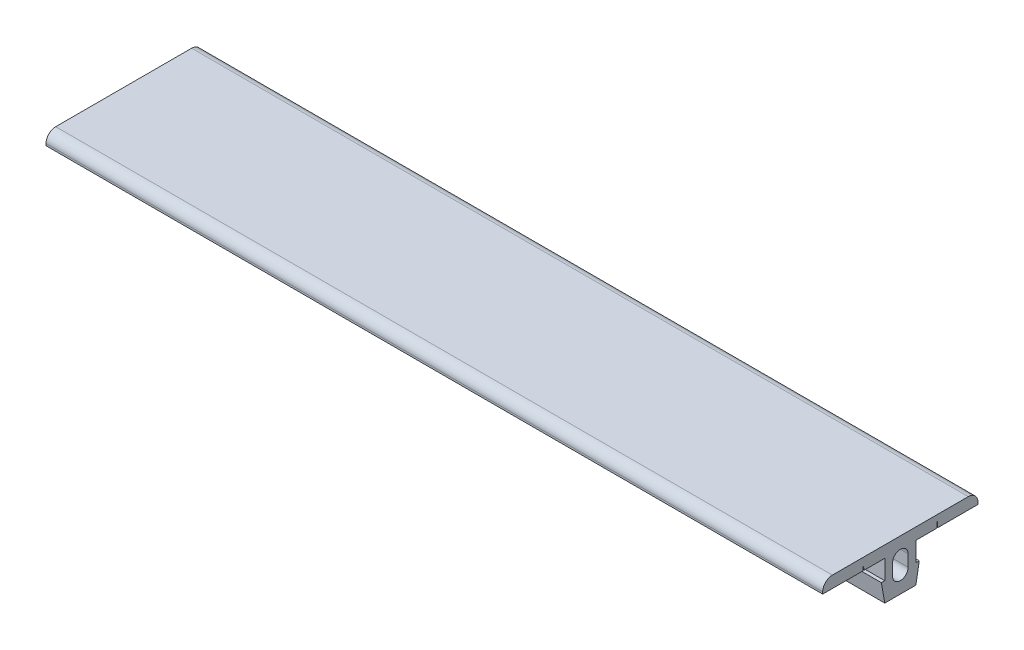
ISO-10303-21;
HEADER;
FILE_DESCRIPTION(('STEP AP214'),'2;1');
FILE_NAME('part.step','',(''),(''),'','','');
FILE_SCHEMA(('AUTOMOTIVE_DESIGN { 1 0 10303 214 1 1 1 1 }'));
ENDSEC;
DATA;
#1=APPLICATION_CONTEXT('core data for automotive mechanical design processes');
#2=APPLICATION_PROTOCOL_DEFINITION('international standard','automotive_design',2000,#1);
#3=PRODUCT_CONTEXT('',#1,'mechanical');
#4=PRODUCT('Part','Part','',(#3));
#5=PRODUCT_RELATED_PRODUCT_CATEGORY('part','',(#4));
#6=PRODUCT_DEFINITION_FORMATION('','',#4);
#7=PRODUCT_DEFINITION_CONTEXT('part definition',#1,'design');
#8=PRODUCT_DEFINITION('design','',#6,#7);
#9=PRODUCT_DEFINITION_SHAPE('','',#8);
#10=(LENGTH_UNIT() NAMED_UNIT(*) SI_UNIT(.MILLI.,.METRE.));
#11=(NAMED_UNIT(*) PLANE_ANGLE_UNIT() SI_UNIT($,.RADIAN.));
#12=(NAMED_UNIT(*) SI_UNIT($,.STERADIAN.) SOLID_ANGLE_UNIT());
#13=UNCERTAINTY_MEASURE_WITH_UNIT(LENGTH_MEASURE(1.E-05),#10,'distance_accuracy_value','');
#14=(GEOMETRIC_REPRESENTATION_CONTEXT(3) GLOBAL_UNCERTAINTY_ASSIGNED_CONTEXT((#13)) GLOBAL_UNIT_ASSIGNED_CONTEXT((#10,
#11,#12)) REPRESENTATION_CONTEXT('',''));
#15=CARTESIAN_POINT('',(0.,0.,0.));
#16=DIRECTION('',(0.,0.,1.));
#17=DIRECTION('',(1.,0.,0.));
#18=AXIS2_PLACEMENT_3D('',#15,#16,#17);
#19=CARTESIAN_POINT('',(200.,4.93374739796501,-9.500000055));
#20=DIRECTION('',(0.,0.0871107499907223,-0.996198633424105));
#21=DIRECTION('',(0.,0.996198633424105,0.0871107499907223));
#22=AXIS2_PLACEMENT_3D('',#19,#20,#21);
#23=PLANE('',#22);
#24=DIRECTION('',(0.,-0.996198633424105,-0.0871107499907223));
#25=VECTOR('',#24,1.);
#26=CARTESIAN_POINT('',(0.,4.93374739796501,-9.500000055));
#27=LINE('',#26,#25);
#28=CARTESIAN_POINT('',(0.,4.93374739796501,-9.500000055));
#29=VERTEX_POINT('',#28);
#30=CARTESIAN_POINT('',(0.,3.43444739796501,-9.631103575));
#31=VERTEX_POINT('',#30);
#32=EDGE_CURVE('E327',#29,#31,#27,.T.);
#33=ORIENTED_EDGE('',*,*,#32,.T.);
#34=DIRECTION('',(-1.,0.,0.));
#35=VECTOR('',#34,1.);
#36=CARTESIAN_POINT('',(200.,3.43444739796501,-9.631103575));
#37=LINE('',#36,#35);
#38=CARTESIAN_POINT('',(200.,3.43444739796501,-9.631103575));
#39=VERTEX_POINT('',#38);
#40=EDGE_CURVE('E13',#39,#31,#37,.T.);
#41=ORIENTED_EDGE('',*,*,#40,.F.);
#42=DIRECTION('',(0.,-0.996198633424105,-0.0871107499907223));
#43=VECTOR('',#42,1.);
#44=CARTESIAN_POINT('',(200.,4.93374739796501,-9.500000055));
#45=LINE('',#44,#43);
#46=CARTESIAN_POINT('',(200.,4.93374739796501,-9.500000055));
#47=VERTEX_POINT('',#46);
#48=EDGE_CURVE('E484',#47,#39,#45,.T.);
#49=ORIENTED_EDGE('',*,*,#48,.F.);
#50=DIRECTION('',(-1.,0.,0.));
#51=VECTOR('',#50,1.);
#52=CARTESIAN_POINT('',(200.,4.93374739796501,-9.500000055));
#53=LINE('',#52,#51);
#54=EDGE_CURVE('E386',#47,#29,#53,.T.);
#55=ORIENTED_EDGE('',*,*,#54,.T.);
#56=EDGE_LOOP('',(#33,#41,#49,#55));
#57=FACE_BOUND('',#56,.T.);
#58=ADVANCED_FACE('F110',(#57),#23,.F.);
#59=CARTESIAN_POINT('',(200.,3.43444739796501,-9.631103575));
#60=DIRECTION('',(0.,1.,0.));
#61=DIRECTION('',(0.,0.,1.));
#62=AXIS2_PLACEMENT_3D('',#59,#60,#61);
#63=PLANE('',#62);
#64=DIRECTION('',(0.,0.,-1.));
#65=VECTOR('',#64,1.);
#66=CARTESIAN_POINT('',(0.,3.43444739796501,-9.631103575));
#67=LINE('',#66,#65);
#68=CARTESIAN_POINT('',(0.,3.43444739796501,-20.000000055));
#69=VERTEX_POINT('',#68);
#70=EDGE_CURVE('E331',#31,#69,#67,.T.);
#71=ORIENTED_EDGE('',*,*,#70,.T.);
#72=DIRECTION('',(-1.,0.,0.));
#73=VECTOR('',#72,1.);
#74=CARTESIAN_POINT('',(200.,3.43444739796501,-20.000000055));
#75=LINE('',#74,#73);
#76=CARTESIAN_POINT('',(200.,3.43444739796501,-20.000000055));
#77=VERTEX_POINT('',#76);
#78=EDGE_CURVE('E121',#77,#69,#75,.T.);
#79=ORIENTED_EDGE('',*,*,#78,.F.);
#80=DIRECTION('',(0.,0.,-1.));
#81=VECTOR('',#80,1.);
#82=CARTESIAN_POINT('',(200.,3.43444739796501,-9.631103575));
#83=LINE('',#82,#81);
#84=EDGE_CURVE('E487',#39,#77,#83,.T.);
#85=ORIENTED_EDGE('',*,*,#84,.F.);
#86=ORIENTED_EDGE('',*,*,#40,.T.);
#87=EDGE_LOOP('',(#71,#79,#85,#86));
#88=FACE_BOUND('',#87,.T.);
#89=ADVANCED_FACE('F562',(#88),#63,.F.);
#90=CARTESIAN_POINT('',(200.,3.43444739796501,-20.000000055));
#91=DIRECTION('',(0.,0.,1.));
#92=DIRECTION('',(1.,0.,0.));
#93=AXIS2_PLACEMENT_3D('',#90,#91,#92);
#94=PLANE('',#93);
#95=DIRECTION('',(0.,1.,0.));
#96=VECTOR('',#95,1.);
#97=CARTESIAN_POINT('',(0.,3.43444739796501,-20.000000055));
#98=LINE('',#97,#96);
#99=CARTESIAN_POINT('',(0.,3.93444739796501,-20.000000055));
#100=VERTEX_POINT('',#99);
#101=EDGE_CURVE('E334',#69,#100,#98,.T.);
#102=ORIENTED_EDGE('',*,*,#101,.T.);
#103=DIRECTION('',(-1.,0.,0.));
#104=VECTOR('',#103,1.);
#105=CARTESIAN_POINT('',(200.,3.93444739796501,-20.000000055));
#106=LINE('',#105,#104);
#107=CARTESIAN_POINT('',(200.,3.93444739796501,-20.000000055));
#108=VERTEX_POINT('',#107);
#109=EDGE_CURVE('E445',#108,#100,#106,.T.);
#110=ORIENTED_EDGE('',*,*,#109,.F.);
#111=DIRECTION('',(0.,1.,0.));
#112=VECTOR('',#111,1.);
#113=CARTESIAN_POINT('',(200.,3.43444739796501,-20.000000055));
#114=LINE('',#113,#112);
#115=EDGE_CURVE('E493',#77,#108,#114,.T.);
#116=ORIENTED_EDGE('',*,*,#115,.F.);
#117=ORIENTED_EDGE('',*,*,#78,.T.);
#118=EDGE_LOOP('',(#102,#110,#116,#117));
#119=FACE_BOUND('',#118,.T.);
#120=ADVANCED_FACE('F567',(#119),#94,.F.);
#121=CARTESIAN_POINT('',(200.,3.93444739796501,-17.500000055));
#122=DIRECTION('',(-1.,0.,0.));
#123=DIRECTION('',(0.,0.,1.));
#124=AXIS2_PLACEMENT_3D('',#121,#122,#123);
#125=CYLINDRICAL_SURFACE('',#124,2.5);
#126=CARTESIAN_POINT('',(0.,3.93444739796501,-17.500000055));
#127=DIRECTION('',(1.,0.,0.));
#128=DIRECTION('',(0.,0.,-1.));
#129=AXIS2_PLACEMENT_3D('',#126,#127,#128);
#130=CIRCLE('',#129,2.5);
#131=CARTESIAN_POINT('',(0.,6.43444739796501,-17.500000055));
#132=VERTEX_POINT('',#131);
#133=EDGE_CURVE('E337',#100,#132,#130,.T.);
#134=ORIENTED_EDGE('',*,*,#133,.T.);
#135=DIRECTION('',(-1.,0.,0.));
#136=VECTOR('',#135,1.);
#137=CARTESIAN_POINT('',(200.,6.43444739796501,-17.500000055));
#138=LINE('',#137,#136);
#139=CARTESIAN_POINT('',(200.,6.43444739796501,-17.500000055));
#140=VERTEX_POINT('',#139);
#141=EDGE_CURVE('E441',#140,#132,#138,.T.);
#142=ORIENTED_EDGE('',*,*,#141,.F.);
#143=CARTESIAN_POINT('',(200.,3.93444739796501,-17.500000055));
#144=DIRECTION('',(1.,0.,0.));
#145=DIRECTION('',(0.,0.,-1.));
#146=AXIS2_PLACEMENT_3D('',#143,#144,#145);
#147=CIRCLE('',#146,2.5);
#148=EDGE_CURVE('E496',#108,#140,#147,.T.);
#149=ORIENTED_EDGE('',*,*,#148,.F.);
#150=ORIENTED_EDGE('',*,*,#109,.T.);
#151=EDGE_LOOP('',(#134,#142,#149,#150));
#152=FACE_BOUND('',#151,.T.);
#153=ADVANCED_FACE('F632',(#152),#125,.T.);
#154=CARTESIAN_POINT('',(200.,6.43444739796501,-17.500000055));
#155=DIRECTION('',(0.,-1.,0.));
#156=DIRECTION('',(0.,0.,-1.));
#157=AXIS2_PLACEMENT_3D('',#154,#155,#156);
#158=PLANE('',#157);
#159=DIRECTION('',(0.,0.,1.));
#160=VECTOR('',#159,1.);
#161=CARTESIAN_POINT('',(0.,6.43444739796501,-17.500000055));
#162=LINE('',#161,#160);
#163=CARTESIAN_POINT('',(0.,6.43444739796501,17.499999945));
#164=VERTEX_POINT('',#163);
#165=EDGE_CURVE('E340',#132,#164,#162,.T.);
#166=ORIENTED_EDGE('',*,*,#165,.T.);
#167=DIRECTION('',(-1.,0.,0.));
#168=VECTOR('',#167,1.);
#169=CARTESIAN_POINT('',(200.,6.43444739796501,17.499999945));
#170=LINE('',#169,#168);
#171=CARTESIAN_POINT('',(200.,6.43444739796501,17.499999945));
#172=VERTEX_POINT('',#171);
#173=EDGE_CURVE('E437',#172,#164,#170,.T.);
#174=ORIENTED_EDGE('',*,*,#173,.F.);
#175=DIRECTION('',(0.,0.,1.));
#176=VECTOR('',#175,1.);
#177=CARTESIAN_POINT('',(200.,6.43444739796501,-17.500000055));
#178=LINE('',#177,#176);
#179=EDGE_CURVE('E499',#140,#172,#178,.T.);
#180=ORIENTED_EDGE('',*,*,#179,.F.);
#181=ORIENTED_EDGE('',*,*,#141,.T.);
#182=EDGE_LOOP('',(#166,#174,#180,#181));
#183=FACE_BOUND('',#182,.T.);
#184=ADVANCED_FACE('F628',(#183),#158,.F.);
#185=CARTESIAN_POINT('',(200.,3.93444739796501,17.500000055));
#186=DIRECTION('',(-1.,0.,0.));
#187=DIRECTION('',(0.,0.,1.));
#188=AXIS2_PLACEMENT_3D('',#185,#186,#187);
#189=CYLINDRICAL_SURFACE('',#188,2.5);
#190=CARTESIAN_POINT('',(0.,3.93444739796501,17.500000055));
#191=DIRECTION('',(1.,0.,0.));
#192=DIRECTION('',(0.,0.,-1.));
#193=AXIS2_PLACEMENT_3D('',#190,#191,#192);
#194=CIRCLE('',#193,2.5);
#195=CARTESIAN_POINT('',(0.,3.93444739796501,20.000000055));
#196=VERTEX_POINT('',#195);
#197=EDGE_CURVE('E343',#164,#196,#194,.T.);
#198=ORIENTED_EDGE('',*,*,#197,.T.);
#199=DIRECTION('',(-1.,0.,0.));
#200=VECTOR('',#199,1.);
#201=CARTESIAN_POINT('',(200.,3.93444739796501,20.000000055));
#202=LINE('',#201,#200);
#203=CARTESIAN_POINT('',(200.,3.93444739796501,20.000000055));
#204=VERTEX_POINT('',#203);
#205=EDGE_CURVE('E433',#204,#196,#202,.T.);
#206=ORIENTED_EDGE('',*,*,#205,.F.);
#207=CARTESIAN_POINT('',(200.,3.93444739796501,17.500000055));
#208=DIRECTION('',(1.,0.,0.));
#209=DIRECTION('',(0.,0.,-1.));
#210=AXIS2_PLACEMENT_3D('',#207,#208,#209);
#211=CIRCLE('',#210,2.5);
#212=EDGE_CURVE('E502',#172,#204,#211,.T.);
#213=ORIENTED_EDGE('',*,*,#212,.F.);
#214=ORIENTED_EDGE('',*,*,#173,.T.);
#215=EDGE_LOOP('',(#198,#206,#213,#214));
#216=FACE_BOUND('',#215,.T.);
#217=ADVANCED_FACE('F624',(#216),#189,.T.);
#218=CARTESIAN_POINT('',(200.,3.93444739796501,20.000000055));
#219=DIRECTION('',(0.,0.,-1.));
#220=DIRECTION('',(-1.,0.,0.));
#221=AXIS2_PLACEMENT_3D('',#218,#219,#220);
#222=PLANE('',#221);
#223=DIRECTION('',(0.,-1.,0.));
#224=VECTOR('',#223,1.);
#225=CARTESIAN_POINT('',(0.,3.93444739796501,20.000000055));
#226=LINE('',#225,#224);
#227=CARTESIAN_POINT('',(0.,3.43444739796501,20.000000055));
#228=VERTEX_POINT('',#227);
#229=EDGE_CURVE('E346',#196,#228,#226,.T.);
#230=ORIENTED_EDGE('',*,*,#229,.T.);
#231=DIRECTION('',(-1.,0.,0.));
#232=VECTOR('',#231,1.);
#233=CARTESIAN_POINT('',(200.,3.43444739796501,20.000000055));
#234=LINE('',#233,#232);
#235=CARTESIAN_POINT('',(200.,3.43444739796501,20.000000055));
#236=VERTEX_POINT('',#235);
#237=EDGE_CURVE('E429',#236,#228,#234,.T.);
#238=ORIENTED_EDGE('',*,*,#237,.F.);
#239=DIRECTION('',(0.,-1.,0.));
#240=VECTOR('',#239,1.);
#241=CARTESIAN_POINT('',(200.,3.93444739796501,20.000000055));
#242=LINE('',#241,#240);
#243=EDGE_CURVE('E505',#204,#236,#242,.T.);
#244=ORIENTED_EDGE('',*,*,#243,.F.);
#245=ORIENTED_EDGE('',*,*,#205,.T.);
#246=EDGE_LOOP('',(#230,#238,#244,#245));
#247=FACE_BOUND('',#246,.T.);
#248=ADVANCED_FACE('F620',(#247),#222,.F.);
#249=CARTESIAN_POINT('',(200.,3.43444739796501,20.000000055));
#250=DIRECTION('',(0.,1.,0.));
#251=DIRECTION('',(0.,0.,1.));
#252=AXIS2_PLACEMENT_3D('',#249,#250,#251);
#253=PLANE('',#252);
#254=DIRECTION('',(0.,0.,-1.));
#255=VECTOR('',#254,1.);
#256=CARTESIAN_POINT('',(0.,3.43444739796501,20.000000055));
#257=LINE('',#256,#255);
#258=CARTESIAN_POINT('',(0.,3.43444739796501,9.631103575));
#259=VERTEX_POINT('',#258);
#260=EDGE_CURVE('E349',#228,#259,#257,.T.);
#261=ORIENTED_EDGE('',*,*,#260,.T.);
#262=DIRECTION('',(-1.,0.,0.));
#263=VECTOR('',#262,1.);
#264=CARTESIAN_POINT('',(200.,3.43444739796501,9.631103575));
#265=LINE('',#264,#263);
#266=CARTESIAN_POINT('',(200.,3.43444739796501,9.631103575));
#267=VERTEX_POINT('',#266);
#268=EDGE_CURVE('E425',#267,#259,#265,.T.);
#269=ORIENTED_EDGE('',*,*,#268,.F.);
#270=DIRECTION('',(0.,0.,-1.));
#271=VECTOR('',#270,1.);
#272=CARTESIAN_POINT('',(200.,3.43444739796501,20.000000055));
#273=LINE('',#272,#271);
#274=EDGE_CURVE('E508',#236,#267,#273,.T.);
#275=ORIENTED_EDGE('',*,*,#274,.F.);
#276=ORIENTED_EDGE('',*,*,#237,.T.);
#277=EDGE_LOOP('',(#261,#269,#275,#276));
#278=FACE_BOUND('',#277,.T.);
#279=ADVANCED_FACE('F616',(#278),#253,.F.);
#280=CARTESIAN_POINT('',(200.,3.43444739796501,9.631103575));
#281=DIRECTION('',(0.,0.0871107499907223,0.996198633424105));
#282=DIRECTION('',(0.,-0.996198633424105,0.0871107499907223));
#283=AXIS2_PLACEMENT_3D('',#280,#281,#282);
#284=PLANE('',#283);
#285=DIRECTION('',(0.,0.996198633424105,-0.0871107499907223));
#286=VECTOR('',#285,1.);
#287=CARTESIAN_POINT('',(0.,3.43444739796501,9.631103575));
#288=LINE('',#287,#286);
#289=CARTESIAN_POINT('',(0.,4.93374739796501,9.500000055));
#290=VERTEX_POINT('',#289);
#291=EDGE_CURVE('E352',#259,#290,#288,.T.);
#292=ORIENTED_EDGE('',*,*,#291,.T.);
#293=DIRECTION('',(-1.,0.,0.));
#294=VECTOR('',#293,1.);
#295=CARTESIAN_POINT('',(200.,4.93374739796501,9.500000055));
#296=LINE('',#295,#294);
#297=CARTESIAN_POINT('',(200.,4.93374739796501,9.500000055));
#298=VERTEX_POINT('',#297);
#299=EDGE_CURVE('E421',#298,#290,#296,.T.);
#300=ORIENTED_EDGE('',*,*,#299,.F.);
#301=DIRECTION('',(0.,0.996198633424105,-0.0871107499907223));
#302=VECTOR('',#301,1.);
#303=CARTESIAN_POINT('',(200.,3.43444739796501,9.631103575));
#304=LINE('',#303,#302);
#305=EDGE_CURVE('E511',#267,#298,#304,.T.);
#306=ORIENTED_EDGE('',*,*,#305,.F.);
#307=ORIENTED_EDGE('',*,*,#268,.T.);
#308=EDGE_LOOP('',(#292,#300,#306,#307));
#309=FACE_BOUND('',#308,.T.);
#310=ADVANCED_FACE('F612',(#309),#284,.F.);
#311=CARTESIAN_POINT('',(200.,4.93374739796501,9.500000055));
#312=DIRECTION('',(0.,0.0871107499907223,-0.996198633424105));
#313=DIRECTION('',(0.,0.996198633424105,0.0871107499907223));
#314=AXIS2_PLACEMENT_3D('',#311,#312,#313);
#315=PLANE('',#314);
#316=DIRECTION('',(0.,-0.996198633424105,-0.0871107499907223));
#317=VECTOR('',#316,1.);
#318=CARTESIAN_POINT('',(0.,4.93374739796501,9.500000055));
#319=LINE('',#318,#317);
#320=CARTESIAN_POINT('',(0.,3.43444739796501,9.368896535));
#321=VERTEX_POINT('',#320);
#322=EDGE_CURVE('E355',#290,#321,#319,.T.);
#323=ORIENTED_EDGE('',*,*,#322,.T.);
#324=DIRECTION('',(-1.,0.,0.));
#325=VECTOR('',#324,1.);
#326=CARTESIAN_POINT('',(200.,3.43444739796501,9.368896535));
#327=LINE('',#326,#325);
#328=CARTESIAN_POINT('',(200.,3.43444739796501,9.368896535));
#329=VERTEX_POINT('',#328);
#330=EDGE_CURVE('E417',#329,#321,#327,.T.);
#331=ORIENTED_EDGE('',*,*,#330,.F.);
#332=DIRECTION('',(0.,-0.996198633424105,-0.0871107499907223));
#333=VECTOR('',#332,1.);
#334=CARTESIAN_POINT('',(200.,4.93374739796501,9.500000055));
#335=LINE('',#334,#333);
#336=EDGE_CURVE('E514',#298,#329,#335,.T.);
#337=ORIENTED_EDGE('',*,*,#336,.F.);
#338=ORIENTED_EDGE('',*,*,#299,.T.);
#339=EDGE_LOOP('',(#323,#331,#337,#338));
#340=FACE_BOUND('',#339,.T.);
#341=ADVANCED_FACE('F608',(#340),#315,.F.);
#342=CARTESIAN_POINT('',(200.,3.43444739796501,9.368896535));
#343=DIRECTION('',(0.,1.,0.));
#344=DIRECTION('',(0.,0.,1.));
#345=AXIS2_PLACEMENT_3D('',#342,#343,#344);
#346=PLANE('',#345);
#347=DIRECTION('',(0.,0.,-1.));
#348=VECTOR('',#347,1.);
#349=CARTESIAN_POINT('',(0.,3.43444739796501,9.368896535));
#350=LINE('',#349,#348);
#351=CARTESIAN_POINT('',(0.,3.43444739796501,4.000000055));
#352=VERTEX_POINT('',#351);
#353=EDGE_CURVE('E358',#321,#352,#350,.T.);
#354=ORIENTED_EDGE('',*,*,#353,.T.);
#355=DIRECTION('',(-1.,0.,0.));
#356=VECTOR('',#355,1.);
#357=CARTESIAN_POINT('',(200.,3.43444739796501,4.000000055));
#358=LINE('',#357,#356);
#359=CARTESIAN_POINT('',(200.,3.43444739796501,4.000000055));
#360=VERTEX_POINT('',#359);
#361=EDGE_CURVE('E413',#360,#352,#358,.T.);
#362=ORIENTED_EDGE('',*,*,#361,.F.);
#363=DIRECTION('',(0.,0.,-1.));
#364=VECTOR('',#363,1.);
#365=CARTESIAN_POINT('',(200.,3.43444739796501,9.368896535));
#366=LINE('',#365,#364);
#367=EDGE_CURVE('E517',#329,#360,#366,.T.);
#368=ORIENTED_EDGE('',*,*,#367,.F.);
#369=ORIENTED_EDGE('',*,*,#330,.T.);
#370=EDGE_LOOP('',(#354,#362,#368,#369));
#371=FACE_BOUND('',#370,.T.);
#372=ADVANCED_FACE('F604',(#371),#346,.F.);
#373=CARTESIAN_POINT('',(200.,3.43444739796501,4.000000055));
#374=DIRECTION('',(0.,2.20000000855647E-08,-1.));
#375=DIRECTION('',(0.,1.,2.20000000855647E-08));
#376=AXIS2_PLACEMENT_3D('',#373,#374,#375);
#377=PLANE('',#376);
#378=DIRECTION('',(0.,-1.,-2.20000000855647E-08));
#379=VECTOR('',#378,1.);
#380=CARTESIAN_POINT('',(0.,3.43444739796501,4.000000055));
#381=LINE('',#380,#379);
#382=CARTESIAN_POINT('',(0.,-1.56555260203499,3.999999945));
#383=VERTEX_POINT('',#382);
#384=EDGE_CURVE('E361',#352,#383,#381,.T.);
#385=ORIENTED_EDGE('',*,*,#384,.T.);
#386=DIRECTION('',(-1.,0.,0.));
#387=VECTOR('',#386,1.);
#388=CARTESIAN_POINT('',(200.,-1.56555260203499,3.999999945));
#389=LINE('',#388,#387);
#390=CARTESIAN_POINT('',(200.,-1.56555260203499,3.999999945));
#391=VERTEX_POINT('',#390);
#392=EDGE_CURVE('E409',#391,#383,#389,.T.);
#393=ORIENTED_EDGE('',*,*,#392,.F.);
#394=DIRECTION('',(0.,-1.,-2.20000000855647E-08));
#395=VECTOR('',#394,1.);
#396=CARTESIAN_POINT('',(200.,3.43444739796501,4.000000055));
#397=LINE('',#396,#395);
#398=EDGE_CURVE('E520',#360,#391,#397,.T.);
#399=ORIENTED_EDGE('',*,*,#398,.F.);
#400=ORIENTED_EDGE('',*,*,#361,.T.);
#401=EDGE_LOOP('',(#385,#393,#399,#400));
#402=FACE_BOUND('',#401,.T.);
#403=ADVANCED_FACE('F600',(#402),#377,.F.);
#404=CARTESIAN_POINT('',(200.,-1.56555260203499,3.999999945));
#405=DIRECTION('',(0.,-1.,0.));
#406=DIRECTION('',(0.,0.,-1.));
#407=AXIS2_PLACEMENT_3D('',#404,#405,#406);
#408=PLANE('',#407);
#409=DIRECTION('',(0.,0.,1.));
#410=VECTOR('',#409,1.);
#411=CARTESIAN_POINT('',(0.,-1.56555260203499,3.999999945));
#412=LINE('',#411,#410);
#413=CARTESIAN_POINT('',(0.,-1.56555260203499,4.881591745));
#414=VERTEX_POINT('',#413);
#415=EDGE_CURVE('E364',#383,#414,#412,.T.);
#416=ORIENTED_EDGE('',*,*,#415,.T.);
#417=DIRECTION('',(-1.,0.,0.));
#418=VECTOR('',#417,1.);
#419=CARTESIAN_POINT('',(200.,-1.56555260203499,4.881591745));
#420=LINE('',#419,#418);
#421=CARTESIAN_POINT('',(200.,-1.56555260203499,4.881591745));
#422=VERTEX_POINT('',#421);
#423=EDGE_CURVE('E405',#422,#414,#420,.T.);
#424=ORIENTED_EDGE('',*,*,#423,.F.);
#425=DIRECTION('',(0.,0.,1.));
#426=VECTOR('',#425,1.);
#427=CARTESIAN_POINT('',(200.,-1.56555260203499,3.999999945));
#428=LINE('',#427,#426);
#429=EDGE_CURVE('E523',#391,#422,#428,.T.);
#430=ORIENTED_EDGE('',*,*,#429,.F.);
#431=ORIENTED_EDGE('',*,*,#392,.T.);
#432=EDGE_LOOP('',(#416,#424,#430,#431));
#433=FACE_BOUND('',#432,.T.);
#434=ADVANCED_FACE('F596',(#433),#408,.F.);
#435=CARTESIAN_POINT('',(200.,-1.56555260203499,4.881591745));
#436=DIRECTION('',(0.,0.173639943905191,-0.984809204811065));
#437=DIRECTION('',(0.,0.984809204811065,0.173639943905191));
#438=AXIS2_PLACEMENT_3D('',#435,#436,#437);
#439=PLANE('',#438);
#440=DIRECTION('',(0.,-0.984809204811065,-0.173639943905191));
#441=VECTOR('',#440,1.);
#442=CARTESIAN_POINT('',(0.,-1.56555260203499,4.881591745));
#443=LINE('',#442,#441);
#444=CARTESIAN_POINT('',(0.,-6.56555260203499,3.999999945));
#445=VERTEX_POINT('',#444);
#446=EDGE_CURVE('E367',#414,#445,#443,.T.);
#447=ORIENTED_EDGE('',*,*,#446,.T.);
#448=DIRECTION('',(-1.,0.,0.));
#449=VECTOR('',#448,1.);
#450=CARTESIAN_POINT('',(200.,-6.56555260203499,3.999999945));
#451=LINE('',#450,#449);
#452=CARTESIAN_POINT('',(200.,-6.56555260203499,3.999999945));
#453=VERTEX_POINT('',#452);
#454=EDGE_CURVE('E401',#453,#445,#451,.T.);
#455=ORIENTED_EDGE('',*,*,#454,.F.);
#456=DIRECTION('',(0.,-0.984809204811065,-0.173639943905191));
#457=VECTOR('',#456,1.);
#458=CARTESIAN_POINT('',(200.,-1.56555260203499,4.881591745));
#459=LINE('',#458,#457);
#460=EDGE_CURVE('E526',#422,#453,#459,.T.);
#461=ORIENTED_EDGE('',*,*,#460,.F.);
#462=ORIENTED_EDGE('',*,*,#423,.T.);
#463=EDGE_LOOP('',(#447,#455,#461,#462));
#464=FACE_BOUND('',#463,.T.);
#465=ADVANCED_FACE('F592',(#464),#439,.F.);
#466=CARTESIAN_POINT('',(200.,-6.56555260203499,3.999999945));
#467=DIRECTION('',(0.,1.,0.));
#468=DIRECTION('',(0.,0.,1.));
#469=AXIS2_PLACEMENT_3D('',#466,#467,#468);
#470=PLANE('',#469);
#471=DIRECTION('',(0.,0.,-1.));
#472=VECTOR('',#471,1.);
#473=CARTESIAN_POINT('',(0.,-6.56555260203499,3.999999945));
#474=LINE('',#473,#472);
#475=CARTESIAN_POINT('',(0.,-6.56555260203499,-4.000000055));
#476=VERTEX_POINT('',#475);
#477=EDGE_CURVE('E370',#445,#476,#474,.T.);
#478=ORIENTED_EDGE('',*,*,#477,.T.);
#479=DIRECTION('',(-1.,0.,0.));
#480=VECTOR('',#479,1.);
#481=CARTESIAN_POINT('',(200.,-6.56555260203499,-4.000000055));
#482=LINE('',#481,#480);
#483=CARTESIAN_POINT('',(200.,-6.56555260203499,-4.000000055));
#484=VERTEX_POINT('',#483);
#485=EDGE_CURVE('E397',#484,#476,#482,.T.);
#486=ORIENTED_EDGE('',*,*,#485,.F.);
#487=DIRECTION('',(0.,0.,-1.));
#488=VECTOR('',#487,1.);
#489=CARTESIAN_POINT('',(200.,-6.56555260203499,3.999999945));
#490=LINE('',#489,#488);
#491=EDGE_CURVE('E529',#453,#484,#490,.T.);
#492=ORIENTED_EDGE('',*,*,#491,.F.);
#493=ORIENTED_EDGE('',*,*,#454,.T.);
#494=EDGE_LOOP('',(#478,#486,#492,#493));
#495=FACE_BOUND('',#494,.T.);
#496=ADVANCED_FACE('F589',(#495),#470,.F.);
#497=CARTESIAN_POINT('',(200.,-6.56555260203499,-4.000000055));
#498=DIRECTION('',(0.,0.173639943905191,0.984809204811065));
#499=DIRECTION('',(0.,-0.984809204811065,0.173639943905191));
#500=AXIS2_PLACEMENT_3D('',#497,#498,#499);
#501=PLANE('',#500);
#502=DIRECTION('',(0.,0.984809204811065,-0.173639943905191));
#503=VECTOR('',#502,1.);
#504=CARTESIAN_POINT('',(0.,-6.56555260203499,-4.000000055));
#505=LINE('',#504,#503);
#506=CARTESIAN_POINT('',(0.,-1.56555260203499,-4.881591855));
#507=VERTEX_POINT('',#506);
#508=EDGE_CURVE('E373',#476,#507,#505,.T.);
#509=ORIENTED_EDGE('',*,*,#508,.T.);
#510=DIRECTION('',(-1.,0.,0.));
#511=VECTOR('',#510,1.);
#512=CARTESIAN_POINT('',(200.,-1.56555260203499,-4.881591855));
#513=LINE('',#512,#511);
#514=CARTESIAN_POINT('',(200.,-1.56555260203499,-4.881591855));
#515=VERTEX_POINT('',#514);
#516=EDGE_CURVE('E393',#515,#507,#513,.T.);
#517=ORIENTED_EDGE('',*,*,#516,.F.);
#518=DIRECTION('',(0.,0.984809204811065,-0.173639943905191));
#519=VECTOR('',#518,1.);
#520=CARTESIAN_POINT('',(200.,-6.56555260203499,-4.000000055));
#521=LINE('',#520,#519);
#522=EDGE_CURVE('E532',#484,#515,#521,.T.);
#523=ORIENTED_EDGE('',*,*,#522,.F.);
#524=ORIENTED_EDGE('',*,*,#485,.T.);
#525=EDGE_LOOP('',(#509,#517,#523,#524));
#526=FACE_BOUND('',#525,.T.);
#527=ADVANCED_FACE('F540',(#526),#501,.F.);
#528=CARTESIAN_POINT('',(200.,-1.56555260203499,-4.881591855));
#529=DIRECTION('',(0.,-1.,0.));
#530=DIRECTION('',(0.,0.,-1.));
#531=AXIS2_PLACEMENT_3D('',#528,#529,#530);
#532=PLANE('',#531);
#533=DIRECTION('',(0.,0.,1.));
#534=VECTOR('',#533,1.);
#535=CARTESIAN_POINT('',(0.,-1.56555260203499,-4.881591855));
#536=LINE('',#535,#534);
#537=CARTESIAN_POINT('',(0.,-1.56555260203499,-4.000000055));
#538=VERTEX_POINT('',#537);
#539=EDGE_CURVE('E376',#507,#538,#536,.T.);
#540=ORIENTED_EDGE('',*,*,#539,.T.);
#541=DIRECTION('',(-1.,0.,0.));
#542=VECTOR('',#541,1.);
#543=CARTESIAN_POINT('',(200.,-1.56555260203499,-4.000000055));
#544=LINE('',#543,#542);
#545=CARTESIAN_POINT('',(200.,-1.56555260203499,-4.000000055));
#546=VERTEX_POINT('',#545);
#547=EDGE_CURVE('E300',#546,#538,#544,.T.);
#548=ORIENTED_EDGE('',*,*,#547,.F.);
#549=DIRECTION('',(0.,0.,1.));
#550=VECTOR('',#549,1.);
#551=CARTESIAN_POINT('',(200.,-1.56555260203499,-4.881591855));
#552=LINE('',#551,#550);
#553=EDGE_CURVE('E289',#515,#546,#552,.T.);
#554=ORIENTED_EDGE('',*,*,#553,.F.);
#555=ORIENTED_EDGE('',*,*,#516,.T.);
#556=EDGE_LOOP('',(#540,#548,#554,#555));
#557=FACE_BOUND('',#556,.T.);
#558=ADVANCED_FACE('F544',(#557),#532,.F.);
#559=CARTESIAN_POINT('',(200.,-1.56555260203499,-4.000000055));
#560=DIRECTION('',(0.,0.,1.));
#561=DIRECTION('',(1.,0.,0.));
#562=AXIS2_PLACEMENT_3D('',#559,#560,#561);
#563=PLANE('',#562);
#564=DIRECTION('',(0.,1.,0.));
#565=VECTOR('',#564,1.);
#566=CARTESIAN_POINT('',(0.,-1.56555260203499,-4.000000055));
#567=LINE('',#566,#565);
#568=CARTESIAN_POINT('',(0.,3.43444739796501,-4.000000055));
#569=VERTEX_POINT('',#568);
#570=EDGE_CURVE('E298',#538,#569,#567,.T.);
#571=ORIENTED_EDGE('',*,*,#570,.T.);
#572=DIRECTION('',(-1.,0.,0.));
#573=VECTOR('',#572,1.);
#574=CARTESIAN_POINT('',(200.,3.43444739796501,-4.000000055));
#575=LINE('',#574,#573);
#576=CARTESIAN_POINT('',(200.,3.43444739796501,-4.000000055));
#577=VERTEX_POINT('',#576);
#578=EDGE_CURVE('E295',#577,#569,#575,.T.);
#579=ORIENTED_EDGE('',*,*,#578,.F.);
#580=DIRECTION('',(0.,1.,0.));
#581=VECTOR('',#580,1.);
#582=CARTESIAN_POINT('',(200.,-1.56555260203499,-4.000000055));
#583=LINE('',#582,#581);
#584=EDGE_CURVE('E283',#546,#577,#583,.T.);
#585=ORIENTED_EDGE('',*,*,#584,.F.);
#586=ORIENTED_EDGE('',*,*,#547,.T.);
#587=EDGE_LOOP('',(#571,#579,#585,#586));
#588=FACE_BOUND('',#587,.T.);
#589=ADVANCED_FACE('F296',(#588),#563,.F.);
#590=CARTESIAN_POINT('',(200.,3.43444739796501,-4.000000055));
#591=DIRECTION('',(0.,1.,0.));
#592=DIRECTION('',(0.,0.,1.));
#593=AXIS2_PLACEMENT_3D('',#590,#591,#592);
#594=PLANE('',#593);
#595=DIRECTION('',(0.,0.,-1.));
#596=VECTOR('',#595,1.);
#597=CARTESIAN_POINT('',(0.,3.43444739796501,-4.000000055));
#598=LINE('',#597,#596);
#599=CARTESIAN_POINT('',(0.,3.43444739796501,-9.368896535));
#600=VERTEX_POINT('',#599);
#601=EDGE_CURVE('E207',#569,#600,#598,.T.);
#602=ORIENTED_EDGE('',*,*,#601,.T.);
#603=DIRECTION('',(-1.,0.,0.));
#604=VECTOR('',#603,1.);
#605=CARTESIAN_POINT('',(200.,3.43444739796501,-9.368896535));
#606=LINE('',#605,#604);
#607=CARTESIAN_POINT('',(200.,3.43444739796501,-9.368896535));
#608=VERTEX_POINT('',#607);
#609=EDGE_CURVE('E301',#608,#600,#606,.T.);
#610=ORIENTED_EDGE('',*,*,#609,.F.);
#611=DIRECTION('',(0.,0.,-1.));
#612=VECTOR('',#611,1.);
#613=CARTESIAN_POINT('',(200.,3.43444739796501,-4.000000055));
#614=LINE('',#613,#612);
#615=EDGE_CURVE('E287',#577,#608,#614,.T.);
#616=ORIENTED_EDGE('',*,*,#615,.F.);
#617=ORIENTED_EDGE('',*,*,#578,.T.);
#618=EDGE_LOOP('',(#602,#610,#616,#617));
#619=FACE_BOUND('',#618,.T.);
#620=ADVANCED_FACE('F303',(#619),#594,.F.);
#621=CARTESIAN_POINT('',(200.,1.43444739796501,5.499999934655E-08));
#622=DIRECTION('',(-1.,0.,0.));
#623=DIRECTION('',(0.,0.,1.));
#624=AXIS2_PLACEMENT_3D('',#621,#622,#623);
#625=CYLINDRICAL_SURFACE('',#624,2.);
#626=CARTESIAN_POINT('',(0.,1.43444739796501,5.499999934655E-08));
#627=DIRECTION('',(1.,0.,0.));
#628=DIRECTION('',(0.,0.,-1.));
#629=AXIS2_PLACEMENT_3D('',#626,#627,#628);
#630=CIRCLE('',#629,2.);
#631=CARTESIAN_POINT('',(0.,1.43444739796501,-1.999999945));
#632=VERTEX_POINT('',#631);
#633=CARTESIAN_POINT('',(0.,1.43444739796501,2.000000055));
#634=VERTEX_POINT('',#633);
#635=EDGE_CURVE('E311',#632,#634,#630,.T.);
#636=ORIENTED_EDGE('',*,*,#635,.F.);
#637=DIRECTION('',(-1.,0.,0.));
#638=VECTOR('',#637,1.);
#639=CARTESIAN_POINT('',(200.,1.43444739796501,-1.999999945));
#640=LINE('',#639,#638);
#641=CARTESIAN_POINT('',(200.,1.43444739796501,-1.999999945));
#642=VERTEX_POINT('',#641);
#643=EDGE_CURVE('E114',#642,#632,#640,.T.);
#644=ORIENTED_EDGE('',*,*,#643,.F.);
#645=CARTESIAN_POINT('',(200.,1.43444739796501,5.499999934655E-08));
#646=DIRECTION('',(1.,0.,0.));
#647=DIRECTION('',(0.,0.,-1.));
#648=AXIS2_PLACEMENT_3D('',#645,#646,#647);
#649=CIRCLE('',#648,2.);
#650=CARTESIAN_POINT('',(200.,1.43444739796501,2.000000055));
#651=VERTEX_POINT('',#650);
#652=EDGE_CURVE('E385',#642,#651,#649,.T.);
#653=ORIENTED_EDGE('',*,*,#652,.T.);
#654=DIRECTION('',(-1.,0.,0.));
#655=VECTOR('',#654,1.);
#656=CARTESIAN_POINT('',(200.,1.43444739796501,2.000000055));
#657=LINE('',#656,#655);
#658=EDGE_CURVE('E307',#651,#634,#657,.T.);
#659=ORIENTED_EDGE('',*,*,#658,.T.);
#660=EDGE_LOOP('',(#636,#644,#653,#659));
#661=FACE_BOUND('',#660,.T.);
#662=ADVANCED_FACE('F112',(#661),#625,.F.);
#663=CARTESIAN_POINT('',(200.,-1.56555260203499,-1.999999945));
#664=DIRECTION('',(0.,0.,1.));
#665=DIRECTION('',(1.,0.,0.));
#666=AXIS2_PLACEMENT_3D('',#663,#664,#665);
#667=PLANE('',#666);
#668=DIRECTION('',(0.,1.,0.));
#669=VECTOR('',#668,1.);
#670=CARTESIAN_POINT('',(0.,-1.56555260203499,-1.999999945));
#671=LINE('',#670,#669);
#672=CARTESIAN_POINT('',(0.,-1.56555260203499,-1.999999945));
#673=VERTEX_POINT('',#672);
#674=EDGE_CURVE('E315',#673,#632,#671,.T.);
#675=ORIENTED_EDGE('',*,*,#674,.F.);
#676=DIRECTION('',(-1.,0.,0.));
#677=VECTOR('',#676,1.);
#678=CARTESIAN_POINT('',(200.,-1.56555260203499,-1.999999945));
#679=LINE('',#678,#677);
#680=CARTESIAN_POINT('',(200.,-1.56555260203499,-1.999999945));
#681=VERTEX_POINT('',#680);
#682=EDGE_CURVE('E456',#681,#673,#679,.T.);
#683=ORIENTED_EDGE('',*,*,#682,.F.);
#684=DIRECTION('',(0.,1.,0.));
#685=VECTOR('',#684,1.);
#686=CARTESIAN_POINT('',(200.,-1.56555260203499,-1.999999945));
#687=LINE('',#686,#685);
#688=EDGE_CURVE('E467',#681,#642,#687,.T.);
#689=ORIENTED_EDGE('',*,*,#688,.T.);
#690=ORIENTED_EDGE('',*,*,#643,.T.);
#691=EDGE_LOOP('',(#675,#683,#689,#690));
#692=FACE_BOUND('',#691,.T.);
#693=ADVANCED_FACE('F465',(#692),#667,.T.);
#694=CARTESIAN_POINT('',(200.,-1.56555260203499,5.499999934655E-08));
#695=DIRECTION('',(-1.,0.,0.));
#696=DIRECTION('',(0.,0.,1.));
#697=AXIS2_PLACEMENT_3D('',#694,#695,#696);
#698=CYLINDRICAL_SURFACE('',#697,2.);
#699=CARTESIAN_POINT('',(0.,-1.56555260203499,5.499999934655E-08));
#700=DIRECTION('',(1.,0.,0.));
#701=DIRECTION('',(0.,0.,-1.));
#702=AXIS2_PLACEMENT_3D('',#699,#700,#701);
#703=CIRCLE('',#702,2.);
#704=CARTESIAN_POINT('',(0.,-1.56555260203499,2.000000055));
#705=VERTEX_POINT('',#704);
#706=EDGE_CURVE('E319',#705,#673,#703,.T.);
#707=ORIENTED_EDGE('',*,*,#706,.F.);
#708=DIRECTION('',(-1.,0.,0.));
#709=VECTOR('',#708,1.);
#710=CARTESIAN_POINT('',(200.,-1.56555260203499,2.000000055));
#711=LINE('',#710,#709);
#712=CARTESIAN_POINT('',(200.,-1.56555260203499,2.000000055));
#713=VERTEX_POINT('',#712);
#714=EDGE_CURVE('E454',#713,#705,#711,.T.);
#715=ORIENTED_EDGE('',*,*,#714,.F.);
#716=CARTESIAN_POINT('',(200.,-1.56555260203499,5.499999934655E-08));
#717=DIRECTION('',(1.,0.,0.));
#718=DIRECTION('',(0.,0.,-1.));
#719=AXIS2_PLACEMENT_3D('',#716,#717,#718);
#720=CIRCLE('',#719,2.);
#721=EDGE_CURVE('E474',#713,#681,#720,.T.);
#722=ORIENTED_EDGE('',*,*,#721,.T.);
#723=ORIENTED_EDGE('',*,*,#682,.T.);
#724=EDGE_LOOP('',(#707,#715,#722,#723));
#725=FACE_BOUND('',#724,.T.);
#726=ADVANCED_FACE('F472',(#725),#698,.F.);
#727=CARTESIAN_POINT('',(200.,1.43444739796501,2.000000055));
#728=DIRECTION('',(0.,0.,-1.));
#729=DIRECTION('',(-1.,0.,0.));
#730=AXIS2_PLACEMENT_3D('',#727,#728,#729);
#731=PLANE('',#730);
#732=DIRECTION('',(0.,-1.,0.));
#733=VECTOR('',#732,1.);
#734=CARTESIAN_POINT('',(0.,1.43444739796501,2.000000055));
#735=LINE('',#734,#733);
#736=EDGE_CURVE('E323',#634,#705,#735,.T.);
#737=ORIENTED_EDGE('',*,*,#736,.F.);
#738=ORIENTED_EDGE('',*,*,#658,.F.);
#739=DIRECTION('',(0.,-1.,0.));
#740=VECTOR('',#739,1.);
#741=CARTESIAN_POINT('',(200.,1.43444739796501,2.000000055));
#742=LINE('',#741,#740);
#743=EDGE_CURVE('E479',#651,#713,#742,.T.);
#744=ORIENTED_EDGE('',*,*,#743,.T.);
#745=ORIENTED_EDGE('',*,*,#714,.T.);
#746=EDGE_LOOP('',(#737,#738,#744,#745));
#747=FACE_BOUND('',#746,.T.);
#748=ADVANCED_FACE('F482',(#747),#731,.T.);
#749=CARTESIAN_POINT('',(200.,3.43444739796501,-9.368896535));
#750=DIRECTION('',(0.,0.0871107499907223,0.996198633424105));
#751=DIRECTION('',(0.,-0.996198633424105,0.0871107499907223));
#752=AXIS2_PLACEMENT_3D('',#749,#750,#751);
#753=PLANE('',#752);
#754=DIRECTION('',(0.,0.996198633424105,-0.0871107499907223));
#755=VECTOR('',#754,1.);
#756=CARTESIAN_POINT('',(0.,3.43444739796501,-9.368896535));
#757=LINE('',#756,#755);
#758=EDGE_CURVE('E213',#600,#29,#757,.T.);
#759=ORIENTED_EDGE('',*,*,#758,.T.);
#760=ORIENTED_EDGE('',*,*,#54,.F.);
#761=DIRECTION('',(0.,0.996198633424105,-0.0871107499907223));
#762=VECTOR('',#761,1.);
#763=CARTESIAN_POINT('',(200.,3.43444739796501,-9.368896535));
#764=LINE('',#763,#762);
#765=EDGE_CURVE('E130',#608,#47,#764,.T.);
#766=ORIENTED_EDGE('',*,*,#765,.F.);
#767=ORIENTED_EDGE('',*,*,#609,.T.);
#768=EDGE_LOOP('',(#759,#760,#766,#767));
#769=FACE_BOUND('',#768,.T.);
#770=ADVANCED_FACE('F550',(#769),#753,.F.);
#771=CARTESIAN_POINT('',(200.,3.93444739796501,-17.500000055));
#772=DIRECTION('',(1.,0.,0.));
#773=DIRECTION('',(0.,0.,-1.));
#774=AXIS2_PLACEMENT_3D('',#771,#772,#773);
#775=PLANE('',#774);
#776=ORIENTED_EDGE('',*,*,#652,.F.);
#777=ORIENTED_EDGE('',*,*,#688,.F.);
#778=ORIENTED_EDGE('',*,*,#721,.F.);
#779=ORIENTED_EDGE('',*,*,#743,.F.);
#780=EDGE_LOOP('',(#776,#777,#778,#779));
#781=FACE_BOUND('',#780,.T.);
#782=ORIENTED_EDGE('',*,*,#48,.T.);
#783=ORIENTED_EDGE('',*,*,#84,.T.);
#784=ORIENTED_EDGE('',*,*,#115,.T.);
#785=ORIENTED_EDGE('',*,*,#148,.T.);
#786=ORIENTED_EDGE('',*,*,#179,.T.);
#787=ORIENTED_EDGE('',*,*,#212,.T.);
#788=ORIENTED_EDGE('',*,*,#243,.T.);
#789=ORIENTED_EDGE('',*,*,#274,.T.);
#790=ORIENTED_EDGE('',*,*,#305,.T.);
#791=ORIENTED_EDGE('',*,*,#336,.T.);
#792=ORIENTED_EDGE('',*,*,#367,.T.);
#793=ORIENTED_EDGE('',*,*,#398,.T.);
#794=ORIENTED_EDGE('',*,*,#429,.T.);
#795=ORIENTED_EDGE('',*,*,#460,.T.);
#796=ORIENTED_EDGE('',*,*,#491,.T.);
#797=ORIENTED_EDGE('',*,*,#522,.T.);
#798=ORIENTED_EDGE('',*,*,#553,.T.);
#799=ORIENTED_EDGE('',*,*,#584,.T.);
#800=ORIENTED_EDGE('',*,*,#615,.T.);
#801=ORIENTED_EDGE('',*,*,#765,.T.);
#802=EDGE_LOOP('',(#782,#783,#784,#785,#786,#787,#788,#789,#790,#791,#792,#793,#794,#795,#796,
#797,#798,#799,#800,#801));
#803=FACE_BOUND('',#802,.T.);
#804=ADVANCED_FACE('F285',(#781,#803),#775,.T.);
#805=CARTESIAN_POINT('',(0.,3.93444739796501,-17.500000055));
#806=DIRECTION('',(1.,0.,0.));
#807=DIRECTION('',(0.,0.,-1.));
#808=AXIS2_PLACEMENT_3D('',#805,#806,#807);
#809=PLANE('',#808);
#810=ORIENTED_EDGE('',*,*,#635,.T.);
#811=ORIENTED_EDGE('',*,*,#736,.T.);
#812=ORIENTED_EDGE('',*,*,#706,.T.);
#813=ORIENTED_EDGE('',*,*,#674,.T.);
#814=EDGE_LOOP('',(#810,#811,#812,#813));
#815=FACE_BOUND('',#814,.T.);
#816=ORIENTED_EDGE('',*,*,#32,.F.);
#817=ORIENTED_EDGE('',*,*,#758,.F.);
#818=ORIENTED_EDGE('',*,*,#601,.F.);
#819=ORIENTED_EDGE('',*,*,#570,.F.);
#820=ORIENTED_EDGE('',*,*,#539,.F.);
#821=ORIENTED_EDGE('',*,*,#508,.F.);
#822=ORIENTED_EDGE('',*,*,#477,.F.);
#823=ORIENTED_EDGE('',*,*,#446,.F.);
#824=ORIENTED_EDGE('',*,*,#415,.F.);
#825=ORIENTED_EDGE('',*,*,#384,.F.);
#826=ORIENTED_EDGE('',*,*,#353,.F.);
#827=ORIENTED_EDGE('',*,*,#322,.F.);
#828=ORIENTED_EDGE('',*,*,#291,.F.);
#829=ORIENTED_EDGE('',*,*,#260,.F.);
#830=ORIENTED_EDGE('',*,*,#229,.F.);
#831=ORIENTED_EDGE('',*,*,#197,.F.);
#832=ORIENTED_EDGE('',*,*,#165,.F.);
#833=ORIENTED_EDGE('',*,*,#133,.F.);
#834=ORIENTED_EDGE('',*,*,#101,.F.);
#835=ORIENTED_EDGE('',*,*,#70,.F.);
#836=EDGE_LOOP('',(#816,#817,#818,#819,#820,#821,#822,#823,#824,#825,#826,#827,#828,#829,#830,
#831,#832,#833,#834,#835));
#837=FACE_BOUND('',#836,.T.);
#838=ADVANCED_FACE('F470',(#815,#837),#809,.F.);
#839=CLOSED_SHELL('',(#58,#89,#120,#153,#184,#217,#248,#279,#310,#341,#372,#403,#434,#465,#496,
#527,#558,#589,#620,#662,#693,#726,#748,#770,#804,#838));
#840=MANIFOLD_SOLID_BREP('B2',#839);
#841=ADVANCED_BREP_SHAPE_REPRESENTATION('',(#18,#840),#14);
#842=SHAPE_DEFINITION_REPRESENTATION(#9,#841);
ENDSEC;
END-ISO-10303-21;
